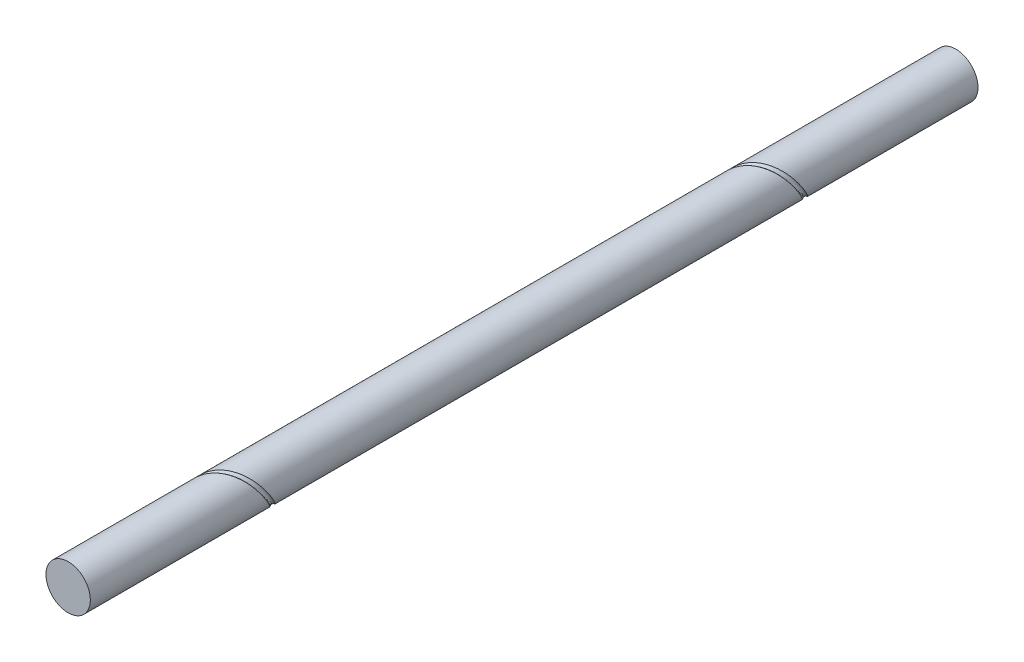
from build123d import *

# Parameters (mm, degrees)
SKETCH1_R              = 25
BOSS_EXTRUDE1_DEPTH    = 1000
CUT_SWEEP1_PITCH       = 100
CUT_SWEEP1_HEIGHT      = 100
CUT_SWEEP1_RADIUS      = 27.646
CUT_SWEEP1_START_ANGLE = -180
SKETCH3_R              = 3.969
LPATTERN1_COUNT        = 2
LPATTERN1_PITCH        = 600


with BuildPart() as part:
    # Sketch1 → Boss-Extrude1 (new body)
    with BuildSketch(Plane.XY):
        Circle(SKETCH1_R)
    extrude(amount=BOSS_EXTRUDE1_DEPTH)

    # Cut-Sweep1: sweep along a helix
    with BuildLine() as cut_sweep1_path:
        add(Helix(CUT_SWEEP1_PITCH, CUT_SWEEP1_HEIGHT, CUT_SWEEP1_RADIUS, center=(0, 0, 150), direction=(0, 0, 1), mode=Mode.PRIVATE).rotate(Axis((0, 0, 150), (0, 0, 1)), CUT_SWEEP1_START_ANGLE))
    # Sketch3 → Cut-Sweep1 (sweep, cut)
    with BuildSketch(Plane(origin=(0, 0, 0), x_dir=(1, 0, 0), z_dir=(0, 1, 0))):
        with Locations((-27.646, -150)):
            Circle(SKETCH3_R)
    cut_sweep1 = sweep(path=cut_sweep1_path.line, is_frenet=True, mode=Mode.SUBTRACT)

    # LPattern1: Cut-Sweep1 ×2
    with Locations(*[(0, 0, i * LPATTERN1_PITCH) for i in range(1, LPATTERN1_COUNT)]):
        add(cut_sweep1, mode=Mode.SUBTRACT)


solid = part.part
